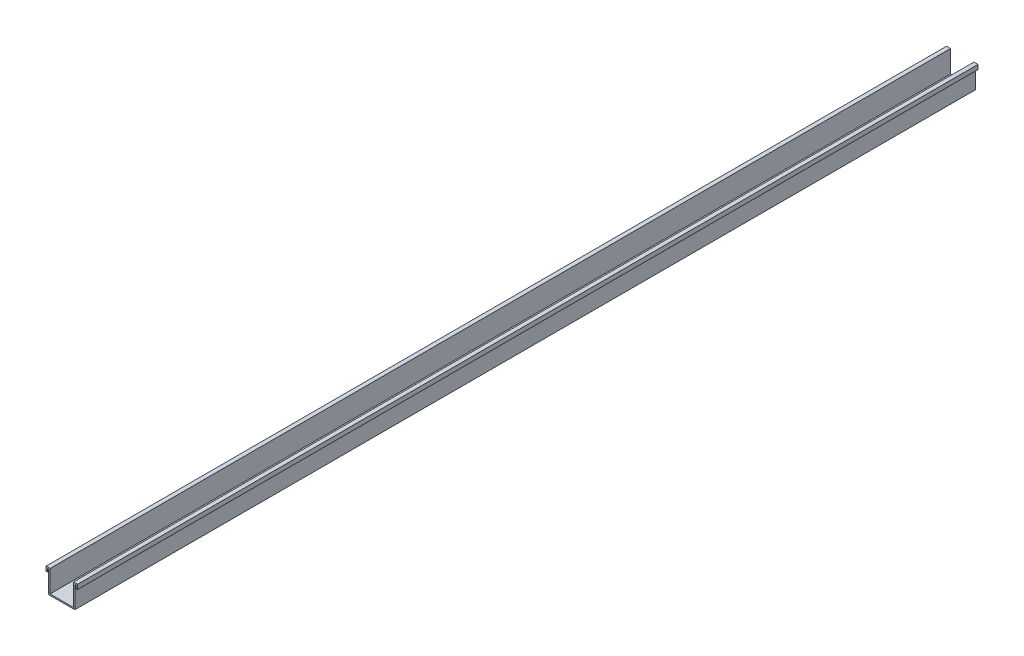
from build123d import *

# Parameters (mm, degrees)
BOSS_EXTRUDE1_DEPTH = 1000


with BuildPart() as part:
    # Sketch1 → Boss-Extrude1 (new body)
    with BuildSketch(Plane.XY):
        Polygon((-16, 24.5), (-14.5, 24.5), (-14.5, 0), (14.5, 0), (14.5, 24.5), (16, 24.5), (16, 21), (17.5, 21), (17.5, 26), (13, 26), (13, 1.5), (-13, 1.5), (-13, 26), (-17.5, 26), (-17.5, 21), (-16, 21), align=None)
    extrude(amount=BOSS_EXTRUDE1_DEPTH)


solid = part.part
